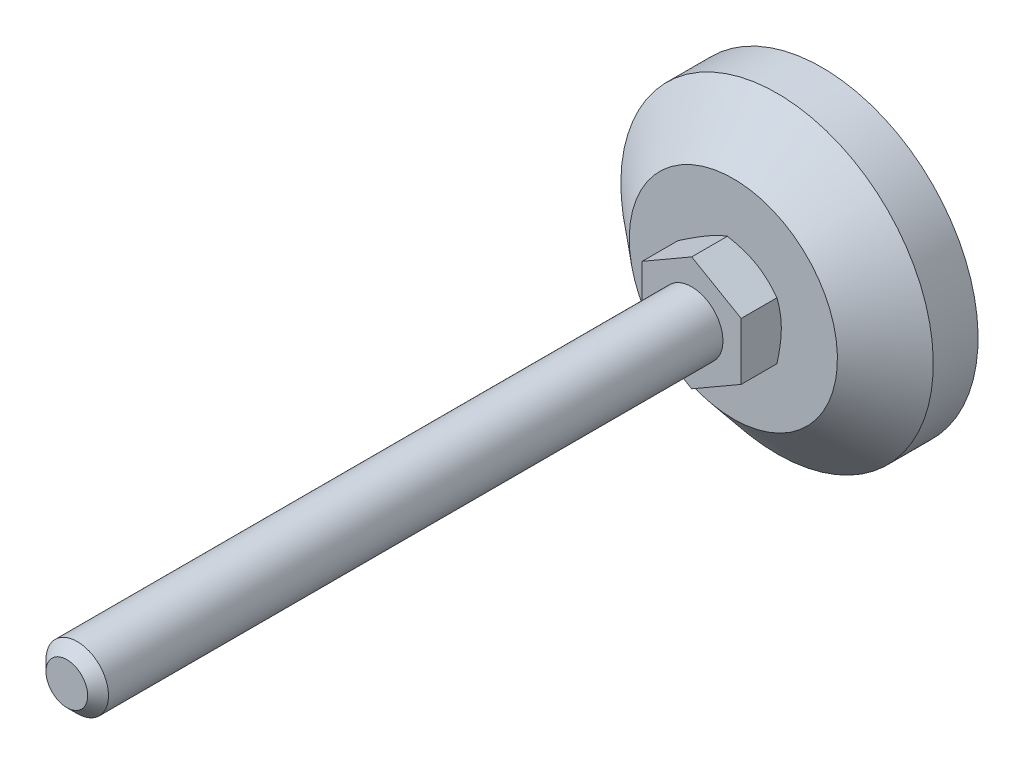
ISO-10303-21;
HEADER;
FILE_DESCRIPTION(('STEP AP214'),'2;1');
FILE_NAME('part.step','',(''),(''),'','','');
FILE_SCHEMA(('AUTOMOTIVE_DESIGN { 1 0 10303 214 1 1 1 1 }'));
ENDSEC;
DATA;
#1=APPLICATION_CONTEXT('core data for automotive mechanical design processes');
#2=APPLICATION_PROTOCOL_DEFINITION('international standard','automotive_design',2000,#1);
#3=PRODUCT_CONTEXT('',#1,'mechanical');
#4=PRODUCT('Part','Part','',(#3));
#5=PRODUCT_RELATED_PRODUCT_CATEGORY('part','',(#4));
#6=PRODUCT_DEFINITION_FORMATION('','',#4);
#7=PRODUCT_DEFINITION_CONTEXT('part definition',#1,'design');
#8=PRODUCT_DEFINITION('design','',#6,#7);
#9=PRODUCT_DEFINITION_SHAPE('','',#8);
#10=(LENGTH_UNIT() NAMED_UNIT(*) SI_UNIT(.MILLI.,.METRE.));
#11=(NAMED_UNIT(*) PLANE_ANGLE_UNIT() SI_UNIT($,.RADIAN.));
#12=(NAMED_UNIT(*) SI_UNIT($,.STERADIAN.) SOLID_ANGLE_UNIT());
#13=UNCERTAINTY_MEASURE_WITH_UNIT(LENGTH_MEASURE(1.E-05),#10,'distance_accuracy_value','');
#14=(GEOMETRIC_REPRESENTATION_CONTEXT(3) GLOBAL_UNCERTAINTY_ASSIGNED_CONTEXT((#13)) GLOBAL_UNIT_ASSIGNED_CONTEXT((#10,
#11,#12)) REPRESENTATION_CONTEXT('',''));
#15=CARTESIAN_POINT('',(0.,0.,0.));
#16=DIRECTION('',(0.,0.,1.));
#17=DIRECTION('',(1.,0.,0.));
#18=AXIS2_PLACEMENT_3D('',#15,#16,#17);
#19=CARTESIAN_POINT('',(0.,0.,25.));
#20=DIRECTION('',(0.,0.,1.));
#21=DIRECTION('',(0.5,-0.866025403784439,0.));
#22=AXIS2_PLACEMENT_3D('',#19,#20,#21);
#23=PLANE('',#22);
#24=DIRECTION('',(0.,1.,0.));
#25=VECTOR('',#24,1.);
#26=CARTESIAN_POINT('',(9.5,-5.48482755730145,25.));
#27=LINE('',#26,#25);
#28=CARTESIAN_POINT('',(9.5,-5.48482755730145,25.));
#29=VERTEX_POINT('',#28);
#30=CARTESIAN_POINT('',(9.5,5.48482755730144,25.));
#31=VERTEX_POINT('',#30);
#32=EDGE_CURVE('E197',#29,#31,#27,.T.);
#33=ORIENTED_EDGE('',*,*,#32,.T.);
#34=DIRECTION('',(-0.866025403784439,0.5,0.));
#35=VECTOR('',#34,1.);
#36=CARTESIAN_POINT('',(9.5,5.48482755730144,25.));
#37=LINE('',#36,#35);
#38=CARTESIAN_POINT('',(0.,10.9696551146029,25.));
#39=VERTEX_POINT('',#38);
#40=EDGE_CURVE('E320',#31,#39,#37,.T.);
#41=ORIENTED_EDGE('',*,*,#40,.T.);
#42=DIRECTION('',(-0.866025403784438,-0.5,0.));
#43=VECTOR('',#42,1.);
#44=CARTESIAN_POINT('',(0.,10.9696551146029,25.));
#45=LINE('',#44,#43);
#46=CARTESIAN_POINT('',(-9.5,5.48482755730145,25.));
#47=VERTEX_POINT('',#46);
#48=EDGE_CURVE('E319',#39,#47,#45,.T.);
#49=ORIENTED_EDGE('',*,*,#48,.T.);
#50=DIRECTION('',(0.,-1.,0.));
#51=VECTOR('',#50,1.);
#52=CARTESIAN_POINT('',(-9.5,5.48482755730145,25.));
#53=LINE('',#52,#51);
#54=CARTESIAN_POINT('',(-9.5,-5.48482755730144,25.));
#55=VERTEX_POINT('',#54);
#56=EDGE_CURVE('E324',#47,#55,#53,.T.);
#57=ORIENTED_EDGE('',*,*,#56,.T.);
#58=DIRECTION('',(0.866025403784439,-0.5,0.));
#59=VECTOR('',#58,1.);
#60=CARTESIAN_POINT('',(-9.5,-5.48482755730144,25.));
#61=LINE('',#60,#59);
#62=CARTESIAN_POINT('',(0.,-10.9696551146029,25.));
#63=VERTEX_POINT('',#62);
#64=EDGE_CURVE('E326',#55,#63,#61,.T.);
#65=ORIENTED_EDGE('',*,*,#64,.T.);
#66=DIRECTION('',(0.866025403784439,0.5,0.));
#67=VECTOR('',#66,1.);
#68=CARTESIAN_POINT('',(0.,-10.9696551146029,25.));
#69=LINE('',#68,#67);
#70=EDGE_CURVE('E37',#63,#29,#69,.T.);
#71=ORIENTED_EDGE('',*,*,#70,.T.);
#72=EDGE_LOOP('',(#33,#41,#49,#57,#65,#71));
#73=FACE_BOUND('',#72,.T.);
#74=CARTESIAN_POINT('',(0.,0.,25.));
#75=DIRECTION('',(0.,0.,1.));
#76=DIRECTION('',(0.5,-0.866025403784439,0.));
#77=AXIS2_PLACEMENT_3D('',#74,#75,#76);
#78=CIRCLE('',#77,6.);
#79=CARTESIAN_POINT('',(3.,-5.19615242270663,25.));
#80=VERTEX_POINT('',#79);
#81=EDGE_CURVE('E201',#80,#80,#78,.T.);
#82=ORIENTED_EDGE('',*,*,#81,.F.);
#83=EDGE_LOOP('',(#82));
#84=FACE_BOUND('',#83,.T.);
#85=ADVANCED_FACE('F14',(#73,#84),#23,.T.);
#86=CARTESIAN_POINT('',(-9.99463491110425,17.3112154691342,17.));
#87=DIRECTION('',(0.,0.,1.));
#88=DIRECTION('',(0.5,-0.866025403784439,0.));
#89=AXIS2_PLACEMENT_3D('',#86,#87,#88);
#90=PLANE('',#89);
#91=CARTESIAN_POINT('',(0.,0.,17.));
#92=DIRECTION('',(0.,0.,-1.));
#93=DIRECTION('',(-0.5,0.866025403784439,0.));
#94=AXIS2_PLACEMENT_3D('',#91,#92,#93);
#95=CIRCLE('',#94,19.9892698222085);
#96=CARTESIAN_POINT('',(-9.99463491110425,17.3112154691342,17.));
#97=VERTEX_POINT('',#96);
#98=EDGE_CURVE('E102',#97,#97,#95,.T.);
#99=ORIENTED_EDGE('',*,*,#98,.F.);
#100=EDGE_LOOP('',(#99));
#101=FACE_BOUND('',#100,.T.);
#102=CARTESIAN_POINT('',(0.,0.,17.));
#103=DIRECTION('',(0.,0.,-1.));
#104=DIRECTION('',(-0.5,0.866025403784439,0.));
#105=AXIS2_PLACEMENT_3D('',#102,#103,#104);
#106=CIRCLE('',#105,9.);
#107=CARTESIAN_POINT('',(-4.5,7.79422863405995,17.));
#108=VERTEX_POINT('',#107);
#109=EDGE_CURVE('E84',#108,#108,#106,.T.);
#110=ORIENTED_EDGE('',*,*,#109,.T.);
#111=EDGE_LOOP('',(#110));
#112=FACE_BOUND('',#111,.T.);
#113=ADVANCED_FACE('F174',(#101,#112),#90,.T.);
#114=CARTESIAN_POINT('',(0.,0.,0.));
#115=DIRECTION('',(0.,0.,-1.));
#116=DIRECTION('',(-0.5,0.866025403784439,0.));
#117=AXIS2_PLACEMENT_3D('',#114,#115,#116);
#118=PLANE('',#117);
#119=CARTESIAN_POINT('',(0.,0.,0.));
#120=DIRECTION('',(0.,0.,-1.));
#121=DIRECTION('',(-0.5,0.866025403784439,0.));
#122=AXIS2_PLACEMENT_3D('',#119,#120,#121);
#123=CIRCLE('',#122,30.);
#124=CARTESIAN_POINT('',(-15.,25.9807621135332,0.));
#125=VERTEX_POINT('',#124);
#126=EDGE_CURVE('E73',#125,#125,#123,.T.);
#127=ORIENTED_EDGE('',*,*,#126,.T.);
#128=EDGE_LOOP('',(#127));
#129=FACE_BOUND('',#128,.T.);
#130=ADVANCED_FACE('F177',(#129),#118,.T.);
#131=CARTESIAN_POINT('',(0.,0.,-75.4972525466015));
#132=DIRECTION('',(0.,0.,-1.));
#133=DIRECTION('',(-0.5,0.866025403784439,0.));
#134=AXIS2_PLACEMENT_3D('',#131,#132,#133);
#135=CYLINDRICAL_SURFACE('',#134,30.);
#136=CARTESIAN_POINT('',(0.,0.,8.6));
#137=DIRECTION('',(0.,0.,-1.));
#138=DIRECTION('',(-0.5,0.866025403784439,0.));
#139=AXIS2_PLACEMENT_3D('',#136,#137,#138);
#140=CIRCLE('',#139,30.);
#141=CARTESIAN_POINT('',(-15.,25.9807621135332,8.6));
#142=VERTEX_POINT('',#141);
#143=EDGE_CURVE('E105',#142,#142,#140,.T.);
#144=ORIENTED_EDGE('',*,*,#143,.T.);
#145=EDGE_LOOP('',(#144));
#146=FACE_BOUND('',#145,.T.);
#147=ORIENTED_EDGE('',*,*,#126,.F.);
#148=EDGE_LOOP('',(#147));
#149=FACE_BOUND('',#148,.T.);
#150=ADVANCED_FACE('F181',(#146,#149),#135,.T.);
#151=CARTESIAN_POINT('',(0.,0.,8.6));
#152=DIRECTION('',(0.,0.,-1.));
#153=DIRECTION('',(-0.5,0.866025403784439,0.));
#154=AXIS2_PLACEMENT_3D('',#151,#152,#153);
#155=CONICAL_SURFACE('',#154,30.,0.872664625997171);
#156=ORIENTED_EDGE('',*,*,#98,.T.);
#157=EDGE_LOOP('',(#156));
#158=FACE_BOUND('',#157,.T.);
#159=ORIENTED_EDGE('',*,*,#143,.F.);
#160=EDGE_LOOP('',(#159));
#161=FACE_BOUND('',#160,.T.);
#162=ADVANCED_FACE('F121',(#158,#161),#155,.T.);
#163=CARTESIAN_POINT('',(0.,0.,20.2070856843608));
#164=DIRECTION('',(0.,0.,1.));
#165=DIRECTION('',(0.5,-0.866025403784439,0.));
#166=AXIS2_PLACEMENT_3D('',#163,#164,#165);
#167=CONICAL_SURFACE('',#166,14.5548353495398,1.0471975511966);
#168=ORIENTED_EDGE('',*,*,#109,.F.);
#169=EDGE_LOOP('',(#168));
#170=FACE_BOUND('',#169,.T.);
#171=CARTESIAN_POINT('',(-8.0629212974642,-15.6247848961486,21.955113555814));
#172=CARTESIAN_POINT('',(-7.88302842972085,-15.5209237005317,21.8541996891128));
#173=CARTESIAN_POINT('',(-7.70292590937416,-15.4169414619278,21.7537843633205));
#174=CARTESIAN_POINT('',(-7.34225784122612,-15.2087096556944,21.5540635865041));
#175=CARTESIAN_POINT('',(-7.16169228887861,-15.1044600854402,21.4547581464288));
#176=CARTESIAN_POINT('',(-6.61918813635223,-14.7912451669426,21.158650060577));
#177=CARTESIAN_POINT('',(-6.25649443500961,-14.5818438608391,20.9636851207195));
#178=CARTESIAN_POINT('',(-5.52674967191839,-14.1605255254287,20.5787866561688));
#179=CARTESIAN_POINT('',(-5.15968567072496,-13.9486010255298,20.3888857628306));
#180=CARTESIAN_POINT('',(-4.42265753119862,-13.5230776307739,20.016769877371));
#181=CARTESIAN_POINT('',(-4.05269352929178,-13.3094788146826,19.834554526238));
#182=CARTESIAN_POINT('',(-3.29714002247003,-12.8732597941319,19.4740509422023));
#183=CARTESIAN_POINT('',(-2.911434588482,-12.650572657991,19.2960849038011));
#184=CARTESIAN_POINT('',(-2.1355321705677,-12.2026051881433,18.953471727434));
#185=CARTESIAN_POINT('',(-1.74533469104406,-11.9773245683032,18.7888260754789));
#186=CARTESIAN_POINT('',(-0.960535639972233,-11.5242206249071,18.4771310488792));
#187=CARTESIAN_POINT('',(-0.565944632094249,-11.2964034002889,18.3300465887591));
#188=CARTESIAN_POINT('',(0.228883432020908,-10.8375092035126,18.0581506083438));
#189=CARTESIAN_POINT('',(0.62911868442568,-10.6064332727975,17.9333321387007));
#190=CARTESIAN_POINT('',(1.43330236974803,-10.1421376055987,17.7125905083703));
#191=CARTESIAN_POINT('',(1.83721725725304,-9.90893723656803,17.6165087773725));
#192=CARTESIAN_POINT('',(2.44681047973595,-9.55698842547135,17.4980679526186));
#193=CARTESIAN_POINT('',(2.65064289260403,-9.4393057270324,17.4628663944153));
#194=CARTESIAN_POINT('',(3.05933909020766,-9.20334486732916,17.4017128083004));
#195=CARTESIAN_POINT('',(3.26420277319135,-9.08506676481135,17.3757598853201));
#196=CARTESIAN_POINT('',(3.67198665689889,-8.84963262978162,17.3339494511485));
#197=CARTESIAN_POINT('',(3.87489694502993,-8.73248232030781,17.3179635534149));
#198=CARTESIAN_POINT('',(4.28112129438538,-8.49794858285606,17.2959174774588));
#199=CARTESIAN_POINT('',(4.48443534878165,-8.38056515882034,17.2898571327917));
#200=CARTESIAN_POINT('',(4.89110353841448,-8.14577517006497,17.2878069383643));
#201=CARTESIAN_POINT('',(5.09445767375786,-8.02836860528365,17.2918171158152));
#202=CARTESIAN_POINT('',(5.50083733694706,-7.79374519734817,17.3098091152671));
#203=CARTESIAN_POINT('',(5.70386284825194,-7.67652836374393,17.3237914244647));
#204=CARTESIAN_POINT('',(6.19015483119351,-7.39576755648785,17.3689276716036));
#205=CARTESIAN_POINT('',(6.47310620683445,-7.23240550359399,17.4047077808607));
#206=CARTESIAN_POINT('',(7.03693098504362,-6.90688111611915,17.4936993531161));
#207=CARTESIAN_POINT('',(7.31780410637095,-6.74471894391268,17.546913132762));
#208=CARTESIAN_POINT('',(8.15697152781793,-6.2602254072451,17.729885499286));
#209=CARTESIAN_POINT('',(8.71150741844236,-5.94006396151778,17.8829428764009));
#210=CARTESIAN_POINT('',(9.54078576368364,-5.4612798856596,18.148698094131));
#211=CARTESIAN_POINT('',(9.819821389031,-5.30017859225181,18.2445639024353));
#212=CARTESIAN_POINT('',(10.375183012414,-4.97954040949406,18.4463370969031));
#213=CARTESIAN_POINT('',(10.6515089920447,-4.82000353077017,18.552244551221));
#214=CARTESIAN_POINT('',(11.201537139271,-4.50244463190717,18.7723946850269));
#215=CARTESIAN_POINT('',(11.4752401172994,-4.34442214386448,18.8866346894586));
#216=CARTESIAN_POINT('',(12.0203730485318,-4.02968949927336,19.1220972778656));
#217=CARTESIAN_POINT('',(12.2918030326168,-3.87297932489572,19.2433197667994));
#218=CARTESIAN_POINT('',(12.9489666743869,-3.4935657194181,19.544986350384));
#219=CARTESIAN_POINT('',(13.3336498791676,-3.27146876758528,19.7284765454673));
#220=CARTESIAN_POINT('',(14.0996081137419,-2.82924257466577,20.104736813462));
#221=CARTESIAN_POINT('',(14.4808829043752,-2.60911347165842,20.2975075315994));
#222=CARTESIAN_POINT('',(15.2406869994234,-2.170440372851,20.6904048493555));
#223=CARTESIAN_POINT('',(15.619215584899,-1.95189679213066,20.8905332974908));
#224=CARTESIAN_POINT('',(16.3739075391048,-1.51617518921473,21.2966079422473));
#225=CARTESIAN_POINT('',(16.7500709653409,-1.29899713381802,21.5025539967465));
#226=CARTESIAN_POINT('',(17.5008876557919,-0.865512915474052,21.9193891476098));
#227=CARTESIAN_POINT('',(17.8755385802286,-0.649208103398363,22.1302838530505));
#228=CARTESIAN_POINT('',(18.6232021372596,-0.217544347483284,22.5559100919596));
#229=CARTESIAN_POINT('',(18.9962147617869,-0.00218540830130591,22.7706416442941));
#230=CARTESIAN_POINT('',(19.7408074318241,0.42770537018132,23.203233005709));
#231=CARTESIAN_POINT('',(20.112387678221,0.642237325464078,23.4210923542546));
#232=CARTESIAN_POINT('',(20.8543824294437,1.07062819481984,23.8594435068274));
#233=CARTESIAN_POINT('',(21.2247969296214,1.28448710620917,24.0799353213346));
#234=CARTESIAN_POINT('',(22.2694002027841,1.88758908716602,24.7056802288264));
#235=CARTESIAN_POINT('',(22.9424390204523,2.2761682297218,25.1134927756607));
#236=CARTESIAN_POINT('',(24.2860532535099,3.05190426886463,25.9345548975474));
#237=CARTESIAN_POINT('',(24.9566285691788,3.439061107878,26.3478046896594));
#238=CARTESIAN_POINT('',(26.2940646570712,4.21123019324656,27.1773352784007));
#239=CARTESIAN_POINT('',(26.9609305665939,4.59624540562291,27.5936050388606));
#240=CARTESIAN_POINT('',(27.9600759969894,5.17310228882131,28.2204041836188));
#241=CARTESIAN_POINT('',(28.2929225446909,5.3652713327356,28.4297301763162));
#242=CARTESIAN_POINT('',(28.958275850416,5.74941324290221,28.8490996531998));
#243=CARTESIAN_POINT('',(29.2907826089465,5.94138610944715,29.0591431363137));
#244=CARTESIAN_POINT('',(29.6231390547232,6.13327219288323,29.269503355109));
#245=B_SPLINE_CURVE_WITH_KNOTS('',3,(#171,#172,#173,#174,#175,#176,#177,#178,#179,#180,#181,
#182,#183,#184,#185,#186,#187,#188,#189,#190,#191,#192,#193,#194,#195,#196,#197,#198,#199,#200,
#201,#202,#203,#204,#205,#206,#207,#208,#209,#210,#211,#212,#213,#214,#215,#216,#217,#218,#219,
#220,#221,#222,#223,#224,#225,#226,#227,#228,#229,#230,#231,#232,#233,#234,#235,#236,#237,#238,
#239,#240,#241,#242,#243,#244),.UNSPECIFIED.,.F.,.F.,(4,2,2,2,2,2,2,2,2,2,2,2,2,2,2,2,2,2,2,2,2,
2,2,2,2,2,2,2,2,2,2,2,2,2,2,2,4),(0.,0.692811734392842,1.38563029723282,2.7714693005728,
4.16474840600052,5.55796235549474,6.99664082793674,8.43547957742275,9.87139378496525,
11.3068590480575,12.734250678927,13.4480473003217,14.1617748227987,14.8661077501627,
15.5704288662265,16.2747518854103,16.9791093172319,17.9645860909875,18.9501938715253,
20.9224706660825,21.9308705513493,22.9392772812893,23.9473616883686,24.9554323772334,
26.397088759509,27.838845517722,29.2809670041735,30.7230532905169,32.1668616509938,
33.6106771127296,35.0542821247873,36.4978928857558,39.1308383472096,41.7638892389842,
44.3899112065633,45.7028456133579,47.0157780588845),.UNSPECIFIED.);
#246=CARTESIAN_POINT('',(0.,-10.9696551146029,18.1371809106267));
#247=VERTEX_POINT('',#246);
#248=CARTESIAN_POINT('',(9.5,-5.48482755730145,18.1371809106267));
#249=VERTEX_POINT('',#248);
#250=EDGE_CURVE('E65',#247,#249,#245,.T.);
#251=ORIENTED_EDGE('',*,*,#250,.F.);
#252=CARTESIAN_POINT('',(-9.5002,-5.4847120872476,18.137247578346));
#253=CARTESIAN_POINT('',(-9.29136922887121,-5.60528058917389,18.0676485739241));
#254=CARTESIAN_POINT('',(-9.0817598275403,-5.72629863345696,18.0012084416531));
#255=CARTESIAN_POINT('',(-8.66086011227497,-5.96930519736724,17.8755224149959));
#256=CARTESIAN_POINT('',(-8.44956926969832,-6.09129402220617,17.8162788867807));
#257=CARTESIAN_POINT('',(-7.81229220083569,-6.45922610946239,17.6504897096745));
#258=CARTESIAN_POINT('',(-7.38379023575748,-6.70662183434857,17.5561895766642));
#259=CARTESIAN_POINT('',(-6.74255666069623,-7.07683821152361,17.4456138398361));
#260=CARTESIAN_POINT('',(-6.53174078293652,-7.19855281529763,17.4141149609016));
#261=CARTESIAN_POINT('',(-6.10913296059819,-7.4425455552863,17.3612933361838));
#262=CARTESIAN_POINT('',(-5.89734099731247,-7.56482370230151,17.3399707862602));
#263=CARTESIAN_POINT('',(-5.47340378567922,-7.80958396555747,17.3080481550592));
#264=CARTESIAN_POINT('',(-5.26125925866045,-7.93206566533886,17.2974353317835));
#265=CARTESIAN_POINT('',(-4.83677424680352,-8.17714220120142,17.2871576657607));
#266=CARTESIAN_POINT('',(-4.62443376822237,-8.29973703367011,17.2874924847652));
#267=CARTESIAN_POINT('',(-4.22745800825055,-8.5289310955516,17.2983485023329));
#268=CARTESIAN_POINT('',(-4.04279470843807,-8.63554650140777,17.3075454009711));
#269=CARTESIAN_POINT('',(-3.67389999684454,-8.84852796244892,17.3340405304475));
#270=CARTESIAN_POINT('',(-3.48966861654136,-8.95489399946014,17.3513393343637));
#271=CARTESIAN_POINT('',(-2.937688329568,-9.27357996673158,17.414979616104));
#272=CARTESIAN_POINT('',(-2.57091646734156,-9.48533580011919,17.4730570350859));
#273=CARTESIAN_POINT('',(-1.83348217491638,-9.91109368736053,17.618251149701));
#274=CARTESIAN_POINT('',(-1.46291385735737,-10.1250414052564,17.7059833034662));
#275=CARTESIAN_POINT('',(-0.727303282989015,-10.5497463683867,17.9050988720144));
#276=CARTESIAN_POINT('',(-0.362251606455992,-10.7605090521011,18.0164355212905));
#277=CARTESIAN_POINT('',(0.000200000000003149,-10.9697705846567,18.137247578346));
#278=B_SPLINE_CURVE_WITH_KNOTS('',3,(#252,#253,#254,#255,#256,#257,#258,#259,#260,#261,#262,
#263,#264,#265,#266,#267,#268,#269,#270,#271,#272,#273,#274,#275,#276,#277),.UNSPECIFIED.,.F.,
.F.,(4,2,2,2,2,2,2,2,2,2,2,2,4),(0.,0.752880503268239,1.50600787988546,3.0154687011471,
3.75167336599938,4.48789219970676,5.22323407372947,5.95855322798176,6.59868084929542,
7.23885375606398,8.52010929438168,9.82978009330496,11.1368800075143),.UNSPECIFIED.);
#279=CARTESIAN_POINT('',(-9.5,-5.48482755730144,18.1371809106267));
#280=VERTEX_POINT('',#279);
#281=EDGE_CURVE('E68',#280,#247,#278,.T.);
#282=ORIENTED_EDGE('',*,*,#281,.F.);
#283=CARTESIAN_POINT('',(-9.5,5.48505849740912,18.137247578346));
#284=CARTESIAN_POINT('',(-9.5,5.24392149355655,18.0676485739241));
#285=CARTESIAN_POINT('',(-9.5,5.0018854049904,18.0012084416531));
#286=CARTESIAN_POINT('',(-9.5,4.51587227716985,17.8755224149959));
#287=CARTESIAN_POINT('',(-9.5,4.27189462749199,17.8162788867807));
#288=CARTESIAN_POINT('',(-9.5,3.53603045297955,17.6504897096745));
#289=CARTESIAN_POINT('',(-9.5,3.04123900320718,17.5561895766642));
#290=CARTESIAN_POINT('',(-9.5,2.3008062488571,17.4456138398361));
#291=CARTESIAN_POINT('',(-9.5,2.05737704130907,17.4141149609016));
#292=CARTESIAN_POINT('',(-9.5,1.56939156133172,17.3612933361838));
#293=CARTESIAN_POINT('',(-9.5,1.32483526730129,17.3399707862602));
#294=CARTESIAN_POINT('',(-9.5,0.835314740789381,17.3080481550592));
#295=CARTESIAN_POINT('',(-9.5,0.590351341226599,17.2974353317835));
#296=CARTESIAN_POINT('',(-9.5,0.100198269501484,17.2871576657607));
#297=CARTESIAN_POINT('',(-9.5,-0.144991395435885,17.2874924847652));
#298=CARTESIAN_POINT('',(-9.5,-0.603379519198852,17.2983485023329));
#299=CARTESIAN_POINT('',(-9.5,-0.816610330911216,17.3075454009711));
#300=CARTESIAN_POINT('',(-9.5,-1.24257325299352,17.3340405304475));
#301=CARTESIAN_POINT('',(-9.5,-1.45530532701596,17.3513393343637));
#302=CARTESIAN_POINT('',(-9.5,-2.09267726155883,17.414979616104));
#303=CARTESIAN_POINT('',(-9.5,-2.51618892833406,17.4730570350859));
#304=CARTESIAN_POINT('',(-9.5,-3.36770470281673,17.618251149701));
#305=CARTESIAN_POINT('',(-9.5,-3.79560013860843,17.7059833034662));
#306=CARTESIAN_POINT('',(-9.5,-4.64501006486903,17.9050988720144));
#307=CARTESIAN_POINT('',(-9.5,-5.06653543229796,18.0164355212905));
#308=CARTESIAN_POINT('',(-9.5,-5.48505849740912,18.137247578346));
#309=B_SPLINE_CURVE_WITH_KNOTS('',3,(#283,#284,#285,#286,#287,#288,#289,#290,#291,#292,#293,
#294,#295,#296,#297,#298,#299,#300,#301,#302,#303,#304,#305,#306,#307,#308),.UNSPECIFIED.,.F.,
.F.,(4,2,2,2,2,2,2,2,2,2,2,2,4),(0.,0.752880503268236,1.50600787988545,3.0154687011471,
3.75167336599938,4.48789219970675,5.22323407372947,5.95855322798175,6.59868084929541,
7.23885375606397,8.52010929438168,9.82978009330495,11.1368800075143),.UNSPECIFIED.);
#310=CARTESIAN_POINT('',(-9.5,5.48482755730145,18.1371809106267));
#311=VERTEX_POINT('',#310);
#312=EDGE_CURVE('E83',#311,#280,#309,.T.);
#313=ORIENTED_EDGE('',*,*,#312,.F.);
#314=CARTESIAN_POINT('',(-17.5629212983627,0.829697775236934,21.9551135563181));
#315=CARTESIAN_POINT('',(-17.3830284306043,0.933558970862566,21.8541996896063));
#316=CARTESIAN_POINT('',(-17.2029259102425,1.03754120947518,21.7537843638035));
#317=CARTESIAN_POINT('',(-16.8422578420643,1.245773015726,21.5540635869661));
#318=CARTESIAN_POINT('',(-16.6616922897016,1.35002258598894,21.4547581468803));
#319=CARTESIAN_POINT('',(-16.1191881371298,1.66323750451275,21.1586500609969));
#320=CARTESIAN_POINT('',(-15.7564944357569,1.8726388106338,20.9636851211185));
#321=CARTESIAN_POINT('',(-15.0267496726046,2.29395714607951,20.5787866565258));
#322=CARTESIAN_POINT('',(-14.6596856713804,2.50588164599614,20.3888857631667));
#323=CARTESIAN_POINT('',(-13.9226575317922,2.93140504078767,20.0167698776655));
#324=CARTESIAN_POINT('',(-13.5526935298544,3.14500385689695,19.8345545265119));
#325=CARTESIAN_POINT('',(-12.7971400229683,3.58122287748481,19.4740509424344));
#326=CARTESIAN_POINT('',(-12.4114345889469,3.80391001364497,19.296084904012));
#327=CARTESIAN_POINT('',(-11.6355321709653,4.25187748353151,18.9534717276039));
#328=CARTESIAN_POINT('',(-11.2453346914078,4.47715810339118,18.7888260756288));
#329=CARTESIAN_POINT('',(-10.4605356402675,4.93026204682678,18.477131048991));
#330=CARTESIAN_POINT('',(-10.065944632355,5.15807927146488,18.3300465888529));
#331=CARTESIAN_POINT('',(-9.27111656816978,5.61697346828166,18.0581506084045));
#332=CARTESIAN_POINT('',(-8.87088131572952,5.84804939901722,17.9333321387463));
#333=CARTESIAN_POINT('',(-8.06669763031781,6.31234506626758,17.7125905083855));
#334=CARTESIAN_POINT('',(-7.66278274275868,6.54554543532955,17.6165087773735));
#335=CARTESIAN_POINT('',(-7.05318952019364,6.89749424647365,17.4980679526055));
#336=CARTESIAN_POINT('',(-6.84935710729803,7.0151769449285,17.4628663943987));
#337=CARTESIAN_POINT('',(-6.44066090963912,7.25113780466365,17.4017128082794));
#338=CARTESIAN_POINT('',(-6.23579722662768,7.36941590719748,17.3757598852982));
#339=CARTESIAN_POINT('',(-5.82801334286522,7.60485004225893,17.3339494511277));
#340=CARTESIAN_POINT('',(-5.62510305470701,7.72200035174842,17.3179635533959));
#341=CARTESIAN_POINT('',(-5.21887870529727,7.95653408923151,17.2959174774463));
#342=CARTESIAN_POINT('',(-5.01556465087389,8.07391751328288,17.2898571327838));
#343=CARTESIAN_POINT('',(-4.60889646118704,8.30870750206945,17.2878069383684));
#344=CARTESIAN_POINT('',(-4.40554232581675,8.42611406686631,17.2918171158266));
#345=CARTESIAN_POINT('',(-3.9991626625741,8.66073747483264,17.3098091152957));
#346=CARTESIAN_POINT('',(-3.79613715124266,8.7779543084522,17.3237914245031));
#347=CARTESIAN_POINT('',(-3.30984516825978,9.05871511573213,17.3689276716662));
#348=CARTESIAN_POINT('',(-3.0268937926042,9.22207716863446,17.4047077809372));
#349=CARTESIAN_POINT('',(-2.46306901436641,9.54760155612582,17.4936993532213));
#350=CARTESIAN_POINT('',(-2.18219589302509,9.70976372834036,17.5469131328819));
#351=CARTESIAN_POINT('',(-1.34302847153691,10.1942572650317,17.7298854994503));
#352=CARTESIAN_POINT('',(-0.788492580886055,10.5144187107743,17.8829428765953));
#353=CARTESIAN_POINT('',(0.0407857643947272,10.9932027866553,18.1486980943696));
#354=CARTESIAN_POINT('',(0.319821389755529,11.1543040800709,18.2445639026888));
#355=CARTESIAN_POINT('',(0.875183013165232,11.474942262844,18.4463370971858));
#356=CARTESIAN_POINT('',(1.15150899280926,11.6344791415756,18.5522445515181));
#357=CARTESIAN_POINT('',(1.70153714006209,11.9520380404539,18.7723946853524));
#358=CARTESIAN_POINT('',(1.97524011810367,12.1100605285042,18.886634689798));
#359=CARTESIAN_POINT('',(2.52037304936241,12.4247931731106,19.1220972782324));
#360=CARTESIAN_POINT('',(2.79180303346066,12.5815033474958,19.2433197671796));
#361=CARTESIAN_POINT('',(3.44896667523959,12.9609169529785,19.5449863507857));
#362=CARTESIAN_POINT('',(3.8336498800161,13.183013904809,19.728476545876));
#363=CARTESIAN_POINT('',(4.5996081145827,13.625240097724,20.1047368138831));
#364=CARTESIAN_POINT('',(4.98088290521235,13.8453692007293,20.2975075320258));
#365=CARTESIAN_POINT('',(5.74068700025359,14.2840422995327,20.6904048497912));
#366=CARTESIAN_POINT('',(6.11921558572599,14.5025858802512,20.8905332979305));
#367=CARTESIAN_POINT('',(6.87390753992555,14.9383074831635,21.2966079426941));
#368=CARTESIAN_POINT('',(7.25007096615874,15.1554855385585,21.5025539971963));
#369=CARTESIAN_POINT('',(8.00088765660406,15.5889697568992,21.9193891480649));
#370=CARTESIAN_POINT('',(8.37553858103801,15.8052745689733,22.1302838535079));
#371=CARTESIAN_POINT('',(9.12320213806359,16.2369383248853,22.5559100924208));
#372=CARTESIAN_POINT('',(9.49621476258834,16.4522972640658,22.7706416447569));
#373=CARTESIAN_POINT('',(10.2408074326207,16.8821880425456,23.2032330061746));
#374=CARTESIAN_POINT('',(10.6123876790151,17.0967199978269,23.4210923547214));
#375=CARTESIAN_POINT('',(11.3543824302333,17.5251108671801,23.8594435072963));
#376=CARTESIAN_POINT('',(11.7247969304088,17.7389697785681,24.0799353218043));
#377=CARTESIAN_POINT('',(12.7694002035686,18.3420717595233,24.7056802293));
#378=CARTESIAN_POINT('',(13.4424390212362,18.7306509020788,25.113492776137));
#379=CARTESIAN_POINT('',(14.786053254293,19.5063869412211,25.9345548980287));
#380=CARTESIAN_POINT('',(15.4566285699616,19.8935437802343,26.3478046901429));
#381=CARTESIAN_POINT('',(16.7940646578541,20.665712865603,27.1773352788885));
#382=CARTESIAN_POINT('',(17.4609305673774,21.0507280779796,27.5936050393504));
#383=CARTESIAN_POINT('',(18.4600759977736,21.6275849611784,28.2204041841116));
#384=CARTESIAN_POINT('',(18.7929225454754,21.8197540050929,28.42973017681));
#385=CARTESIAN_POINT('',(19.4582758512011,22.2038959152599,28.8490996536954));
#386=CARTESIAN_POINT('',(19.7907826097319,22.395868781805,29.0591431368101));
#387=CARTESIAN_POINT('',(20.1231390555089,22.5877548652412,29.2695033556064));
#388=B_SPLINE_CURVE_WITH_KNOTS('',3,(#314,#315,#316,#317,#318,#319,#320,#321,#322,#323,#324,
#325,#326,#327,#328,#329,#330,#331,#332,#333,#334,#335,#336,#337,#338,#339,#340,#341,#342,#343,
#344,#345,#346,#347,#348,#349,#350,#351,#352,#353,#354,#355,#356,#357,#358,#359,#360,#361,#362,
#363,#364,#365,#366,#367,#368,#369,#370,#371,#372,#373,#374,#375,#376,#377,#378,#379,#380,#381,
#382,#383,#384,#385,#386,#387),.UNSPECIFIED.,.F.,.F.,(4,2,2,2,2,2,2,2,2,2,2,2,2,2,2,2,2,2,2,2,2,
2,2,2,2,2,2,2,2,2,2,2,2,2,2,2,4),(0.,0.692811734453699,1.38563029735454,2.77146930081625,
4.16474840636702,5.55796235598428,6.99664082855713,8.43547957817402,9.87139378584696,
11.3068590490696,12.7342506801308,13.4480473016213,14.1617748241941,14.8661077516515,
15.5704288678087,16.2747518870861,16.9791093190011,17.9645860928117,18.9501938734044,
20.9224706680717,21.9308705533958,22.9392772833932,23.9473616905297,24.9554323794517,
26.3970887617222,27.8388455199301,29.2809670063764,30.7230532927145,32.1668616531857,
33.6106771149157,35.0542821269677,36.4978928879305,39.1308383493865,41.7638892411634,
44.3899112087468,45.7028456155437,47.0157780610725),.UNSPECIFIED.);
#389=CARTESIAN_POINT('',(0.,10.9696551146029,18.1371809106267));
#390=VERTEX_POINT('',#389);
#391=EDGE_CURVE('E143',#390,#311,#388,.F.);
#392=ORIENTED_EDGE('',*,*,#391,.F.);
#393=CARTESIAN_POINT('',(9.5002,5.4847120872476,18.137247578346));
#394=CARTESIAN_POINT('',(9.29136922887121,5.60528058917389,18.0676485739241));
#395=CARTESIAN_POINT('',(9.0817598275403,5.72629863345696,18.0012084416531));
#396=CARTESIAN_POINT('',(8.66086011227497,5.96930519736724,17.8755224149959));
#397=CARTESIAN_POINT('',(8.44956926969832,6.09129402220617,17.8162788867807));
#398=CARTESIAN_POINT('',(7.81229220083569,6.45922610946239,17.6504897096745));
#399=CARTESIAN_POINT('',(7.38379023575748,6.70662183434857,17.5561895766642));
#400=CARTESIAN_POINT('',(6.74255666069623,7.07683821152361,17.4456138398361));
#401=CARTESIAN_POINT('',(6.53174078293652,7.19855281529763,17.4141149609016));
#402=CARTESIAN_POINT('',(6.10913296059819,7.4425455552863,17.3612933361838));
#403=CARTESIAN_POINT('',(5.89734099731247,7.56482370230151,17.3399707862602));
#404=CARTESIAN_POINT('',(5.47340378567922,7.80958396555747,17.3080481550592));
#405=CARTESIAN_POINT('',(5.26125925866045,7.93206566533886,17.2974353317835));
#406=CARTESIAN_POINT('',(4.83677424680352,8.17714220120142,17.2871576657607));
#407=CARTESIAN_POINT('',(4.62443376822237,8.29973703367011,17.2874924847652));
#408=CARTESIAN_POINT('',(4.22745800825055,8.5289310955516,17.2983485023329));
#409=CARTESIAN_POINT('',(4.04279470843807,8.63554650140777,17.3075454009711));
#410=CARTESIAN_POINT('',(3.67389999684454,8.84852796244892,17.3340405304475));
#411=CARTESIAN_POINT('',(3.48966861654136,8.95489399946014,17.3513393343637));
#412=CARTESIAN_POINT('',(2.937688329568,9.27357996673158,17.414979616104));
#413=CARTESIAN_POINT('',(2.57091646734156,9.48533580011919,17.4730570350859));
#414=CARTESIAN_POINT('',(1.83348217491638,9.91109368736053,17.618251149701));
#415=CARTESIAN_POINT('',(1.46291385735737,10.1250414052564,17.7059833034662));
#416=CARTESIAN_POINT('',(0.727303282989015,10.5497463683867,17.9050988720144));
#417=CARTESIAN_POINT('',(0.362251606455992,10.7605090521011,18.0164355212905));
#418=CARTESIAN_POINT('',(-0.000200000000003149,10.9697705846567,18.137247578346));
#419=B_SPLINE_CURVE_WITH_KNOTS('',3,(#393,#394,#395,#396,#397,#398,#399,#400,#401,#402,#403,
#404,#405,#406,#407,#408,#409,#410,#411,#412,#413,#414,#415,#416,#417,#418),.UNSPECIFIED.,.F.,
.F.,(4,2,2,2,2,2,2,2,2,2,2,2,4),(0.,0.752880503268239,1.50600787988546,3.0154687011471,
3.75167336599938,4.48789219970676,5.22323407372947,5.95855322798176,6.59868084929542,
7.23885375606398,8.52010929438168,9.82978009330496,11.1368800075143),.UNSPECIFIED.);
#420=CARTESIAN_POINT('',(9.5,5.48482755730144,18.1371809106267));
#421=VERTEX_POINT('',#420);
#422=EDGE_CURVE('E150',#421,#390,#419,.T.);
#423=ORIENTED_EDGE('',*,*,#422,.F.);
#424=CARTESIAN_POINT('',(9.5,-5.48505849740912,18.137247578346));
#425=CARTESIAN_POINT('',(9.5,-5.24392149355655,18.0676485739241));
#426=CARTESIAN_POINT('',(9.5,-5.00188540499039,18.0012084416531));
#427=CARTESIAN_POINT('',(9.5,-4.51587227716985,17.8755224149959));
#428=CARTESIAN_POINT('',(9.5,-4.27189462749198,17.8162788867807));
#429=CARTESIAN_POINT('',(9.5,-3.53603045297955,17.6504897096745));
#430=CARTESIAN_POINT('',(9.5,-3.04123900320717,17.5561895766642));
#431=CARTESIAN_POINT('',(9.5,-2.3008062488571,17.4456138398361));
#432=CARTESIAN_POINT('',(9.5,-2.05737704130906,17.4141149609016));
#433=CARTESIAN_POINT('',(9.5,-1.56939156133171,17.3612933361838));
#434=CARTESIAN_POINT('',(9.5,-1.32483526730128,17.3399707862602));
#435=CARTESIAN_POINT('',(9.5,-0.83531474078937,17.3080481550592));
#436=CARTESIAN_POINT('',(9.5,-0.590351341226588,17.2974353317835));
#437=CARTESIAN_POINT('',(9.5,-0.100198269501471,17.2871576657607));
#438=CARTESIAN_POINT('',(9.5,0.144991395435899,17.2874924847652));
#439=CARTESIAN_POINT('',(9.5,0.603379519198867,17.2983485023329));
#440=CARTESIAN_POINT('',(9.5,0.816610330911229,17.3075454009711));
#441=CARTESIAN_POINT('',(9.5,1.24257325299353,17.3340405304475));
#442=CARTESIAN_POINT('',(9.5,1.45530532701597,17.3513393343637));
#443=CARTESIAN_POINT('',(9.5,2.09267726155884,17.414979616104));
#444=CARTESIAN_POINT('',(9.5,2.51618892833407,17.4730570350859));
#445=CARTESIAN_POINT('',(9.5,3.36770470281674,17.618251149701));
#446=CARTESIAN_POINT('',(9.5,3.79560013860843,17.7059833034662));
#447=CARTESIAN_POINT('',(9.5,4.64501006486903,17.9050988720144));
#448=CARTESIAN_POINT('',(9.5,5.06653543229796,18.0164355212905));
#449=CARTESIAN_POINT('',(9.5,5.48505849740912,18.137247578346));
#450=B_SPLINE_CURVE_WITH_KNOTS('',3,(#424,#425,#426,#427,#428,#429,#430,#431,#432,#433,#434,
#435,#436,#437,#438,#439,#440,#441,#442,#443,#444,#445,#446,#447,#448,#449),.UNSPECIFIED.,.F.,
.F.,(4,2,2,2,2,2,2,2,2,2,2,2,4),(0.,0.75288050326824,1.50600787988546,3.01546870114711,
3.75167336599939,4.48789219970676,5.22323407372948,5.95855322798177,6.59868084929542,
7.23885375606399,8.52010929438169,9.82978009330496,11.1368800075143),.UNSPECIFIED.);
#451=EDGE_CURVE('E29',#249,#421,#450,.T.);
#452=ORIENTED_EDGE('',*,*,#451,.F.);
#453=EDGE_LOOP('',(#251,#282,#313,#392,#423,#452));
#454=FACE_BOUND('',#453,.T.);
#455=ADVANCED_FACE('F67',(#170,#454),#167,.T.);
#456=CARTESIAN_POINT('',(0.,-10.9696551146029,25.));
#457=DIRECTION('',(-0.5,0.866025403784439,0.));
#458=DIRECTION('',(0.,0.,1.));
#459=AXIS2_PLACEMENT_3D('',#456,#457,#458);
#460=PLANE('',#459);
#461=DIRECTION('',(0.,0.,-1.));
#462=VECTOR('',#461,1.);
#463=CARTESIAN_POINT('',(0.,-10.9696551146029,25.));
#464=LINE('',#463,#462);
#465=EDGE_CURVE('E80',#63,#247,#464,.T.);
#466=ORIENTED_EDGE('',*,*,#465,.T.);
#467=ORIENTED_EDGE('',*,*,#250,.T.);
#468=DIRECTION('',(0.,0.,-1.));
#469=VECTOR('',#468,1.);
#470=CARTESIAN_POINT('',(9.5,-5.48482755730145,25.));
#471=LINE('',#470,#469);
#472=EDGE_CURVE('E87',#29,#249,#471,.T.);
#473=ORIENTED_EDGE('',*,*,#472,.F.);
#474=ORIENTED_EDGE('',*,*,#70,.F.);
#475=EDGE_LOOP('',(#466,#467,#473,#474));
#476=FACE_BOUND('',#475,.T.);
#477=ADVANCED_FACE('F86',(#476),#460,.F.);
#478=CARTESIAN_POINT('',(-9.5,-5.48482755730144,25.));
#479=DIRECTION('',(0.5,0.866025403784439,0.));
#480=DIRECTION('',(-0.866025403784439,0.5,0.));
#481=AXIS2_PLACEMENT_3D('',#478,#479,#480);
#482=PLANE('',#481);
#483=DIRECTION('',(0.,0.,-1.));
#484=VECTOR('',#483,1.);
#485=CARTESIAN_POINT('',(-9.5,-5.48482755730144,25.));
#486=LINE('',#485,#484);
#487=EDGE_CURVE('E82',#55,#280,#486,.T.);
#488=ORIENTED_EDGE('',*,*,#487,.T.);
#489=ORIENTED_EDGE('',*,*,#281,.T.);
#490=ORIENTED_EDGE('',*,*,#465,.F.);
#491=ORIENTED_EDGE('',*,*,#64,.F.);
#492=EDGE_LOOP('',(#488,#489,#490,#491));
#493=FACE_BOUND('',#492,.T.);
#494=ADVANCED_FACE('F78',(#493),#482,.F.);
#495=CARTESIAN_POINT('',(-9.5,5.48482755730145,25.));
#496=DIRECTION('',(1.,0.,0.));
#497=DIRECTION('',(0.,1.,0.));
#498=AXIS2_PLACEMENT_3D('',#495,#496,#497);
#499=PLANE('',#498);
#500=DIRECTION('',(0.,0.,-1.));
#501=VECTOR('',#500,1.);
#502=CARTESIAN_POINT('',(-9.5,5.48482755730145,25.));
#503=LINE('',#502,#501);
#504=EDGE_CURVE('E89',#47,#311,#503,.T.);
#505=ORIENTED_EDGE('',*,*,#504,.T.);
#506=ORIENTED_EDGE('',*,*,#312,.T.);
#507=ORIENTED_EDGE('',*,*,#487,.F.);
#508=ORIENTED_EDGE('',*,*,#56,.F.);
#509=EDGE_LOOP('',(#505,#506,#507,#508));
#510=FACE_BOUND('',#509,.T.);
#511=ADVANCED_FACE('F297',(#510),#499,.F.);
#512=CARTESIAN_POINT('',(0.,10.9696551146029,25.));
#513=DIRECTION('',(0.5,-0.866025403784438,0.));
#514=DIRECTION('',(0.866025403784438,0.5,0.));
#515=AXIS2_PLACEMENT_3D('',#512,#513,#514);
#516=PLANE('',#515);
#517=DIRECTION('',(0.,0.,-1.));
#518=VECTOR('',#517,1.);
#519=CARTESIAN_POINT('',(0.,10.9696551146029,25.));
#520=LINE('',#519,#518);
#521=EDGE_CURVE('E96',#39,#390,#520,.T.);
#522=ORIENTED_EDGE('',*,*,#521,.T.);
#523=ORIENTED_EDGE('',*,*,#391,.T.);
#524=ORIENTED_EDGE('',*,*,#504,.F.);
#525=ORIENTED_EDGE('',*,*,#48,.F.);
#526=EDGE_LOOP('',(#522,#523,#524,#525));
#527=FACE_BOUND('',#526,.T.);
#528=ADVANCED_FACE('F167',(#527),#516,.F.);
#529=CARTESIAN_POINT('',(9.5,5.48482755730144,25.));
#530=DIRECTION('',(-0.5,-0.866025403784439,0.));
#531=DIRECTION('',(0.866025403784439,-0.5,0.));
#532=AXIS2_PLACEMENT_3D('',#529,#530,#531);
#533=PLANE('',#532);
#534=DIRECTION('',(0.,0.,-1.));
#535=VECTOR('',#534,1.);
#536=CARTESIAN_POINT('',(9.5,5.48482755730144,25.));
#537=LINE('',#536,#535);
#538=EDGE_CURVE('E99',#31,#421,#537,.T.);
#539=ORIENTED_EDGE('',*,*,#538,.T.);
#540=ORIENTED_EDGE('',*,*,#422,.T.);
#541=ORIENTED_EDGE('',*,*,#521,.F.);
#542=ORIENTED_EDGE('',*,*,#40,.F.);
#543=EDGE_LOOP('',(#539,#540,#541,#542));
#544=FACE_BOUND('',#543,.T.);
#545=ADVANCED_FACE('F163',(#544),#533,.F.);
#546=CARTESIAN_POINT('',(9.5,-5.48482755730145,25.));
#547=DIRECTION('',(-1.,0.,0.));
#548=DIRECTION('',(0.,-1.,0.));
#549=AXIS2_PLACEMENT_3D('',#546,#547,#548);
#550=PLANE('',#549);
#551=ORIENTED_EDGE('',*,*,#472,.T.);
#552=ORIENTED_EDGE('',*,*,#451,.T.);
#553=ORIENTED_EDGE('',*,*,#538,.F.);
#554=ORIENTED_EDGE('',*,*,#32,.F.);
#555=EDGE_LOOP('',(#551,#552,#553,#554));
#556=FACE_BOUND('',#555,.T.);
#557=ADVANCED_FACE('F166',(#556),#550,.F.);
#558=CARTESIAN_POINT('',(0.,0.,145.));
#559=DIRECTION('',(0.,0.,-1.));
#560=DIRECTION('',(-0.5,0.866025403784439,0.));
#561=AXIS2_PLACEMENT_3D('',#558,#559,#560);
#562=CYLINDRICAL_SURFACE('',#561,6.);
#563=CARTESIAN_POINT('',(0.,0.,143.));
#564=DIRECTION('',(0.,0.,1.));
#565=DIRECTION('',(0.5,-0.866025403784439,0.));
#566=AXIS2_PLACEMENT_3D('',#563,#564,#565);
#567=CIRCLE('',#566,6.);
#568=CARTESIAN_POINT('',(3.,-5.19615242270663,143.));
#569=VERTEX_POINT('',#568);
#570=EDGE_CURVE('E9',#569,#569,#567,.F.);
#571=ORIENTED_EDGE('',*,*,#570,.T.);
#572=EDGE_LOOP('',(#571));
#573=FACE_BOUND('',#572,.T.);
#574=ORIENTED_EDGE('',*,*,#81,.T.);
#575=EDGE_LOOP('',(#574));
#576=FACE_BOUND('',#575,.T.);
#577=ADVANCED_FACE('F123',(#573,#576),#562,.T.);
#578=CARTESIAN_POINT('',(0.,0.,145.));
#579=DIRECTION('',(0.,0.,1.));
#580=DIRECTION('',(0.5,-0.866025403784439,0.));
#581=AXIS2_PLACEMENT_3D('',#578,#579,#580);
#582=PLANE('',#581);
#583=CARTESIAN_POINT('',(0.,0.,145.));
#584=DIRECTION('',(0.,0.,1.));
#585=DIRECTION('',(0.5,-0.866025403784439,0.));
#586=AXIS2_PLACEMENT_3D('',#583,#584,#585);
#587=CIRCLE('',#586,4.);
#588=CARTESIAN_POINT('',(2.,-3.46410161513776,145.));
#589=VERTEX_POINT('',#588);
#590=EDGE_CURVE('E22',#589,#589,#587,.T.);
#591=ORIENTED_EDGE('',*,*,#590,.T.);
#592=EDGE_LOOP('',(#591));
#593=FACE_BOUND('',#592,.T.);
#594=ADVANCED_FACE('F208',(#593),#582,.T.);
#595=CARTESIAN_POINT('',(0.,0.,145.));
#596=DIRECTION('',(0.,0.,-1.));
#597=DIRECTION('',(-0.5,0.866025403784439,0.));
#598=AXIS2_PLACEMENT_3D('',#595,#596,#597);
#599=CONICAL_SURFACE('',#598,4.,0.785398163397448);
#600=ORIENTED_EDGE('',*,*,#570,.F.);
#601=EDGE_LOOP('',(#600));
#602=FACE_BOUND('',#601,.T.);
#603=ORIENTED_EDGE('',*,*,#590,.F.);
#604=EDGE_LOOP('',(#603));
#605=FACE_BOUND('',#604,.T.);
#606=ADVANCED_FACE('F16',(#602,#605),#599,.T.);
#607=CLOSED_SHELL('',(#85,#113,#130,#150,#162,#455,#477,#494,#511,#528,#545,#557,#577,#594,#606));
#608=MANIFOLD_SOLID_BREP('B1',#607);
#609=ADVANCED_BREP_SHAPE_REPRESENTATION('',(#18,#608),#14);
#610=SHAPE_DEFINITION_REPRESENTATION(#9,#609);
ENDSEC;
END-ISO-10303-21;
